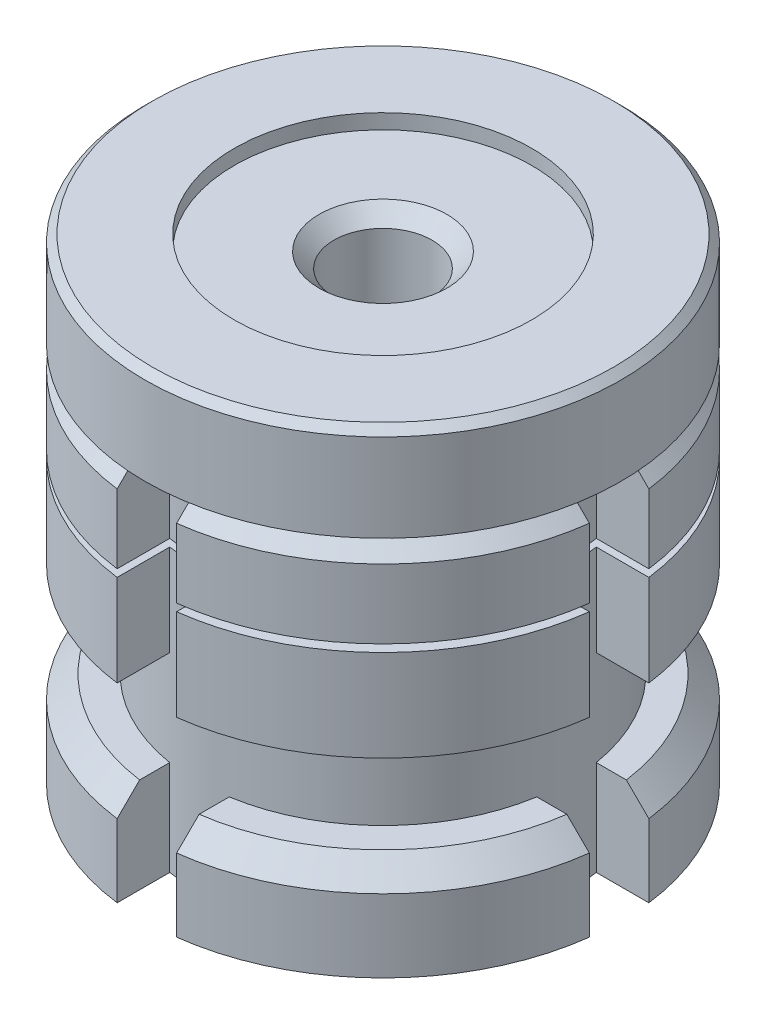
from build123d import *
from build123d.topology import SkipClean

# Parameters (mm, degrees)
SKETCH1_R           = 16
BOSS_EXTRUDE1_DEPTH = 12.8
SKETCH2_W           = 6
SKETCH2_H           = 0.5
SKETCH3_R           = 12.5
BOSS_EXTRUDE2_DEPTH = 12.8
SKETCH4_R           = 16
BOSS_EXTRUDE3_DEPTH = 6.4
CUT_EXTRUDE4_START  = -25.6
CUT_EXTRUDE4_DEPTH  = 25.6
CHAMFER1_SIZE       = 1.5
SKETCH6_R           = 16
BOSS_EXTRUDE4_DEPTH = 6.4
CHAMFER2_SIZE       = 0.5
CUT_EXTRUDE5_START  = -1
SKETCH7_R           = 10
CUT_EXTRUDE5_DEPTH  = 1
SKETCH8_R           = 3.3
CUT_EXTRUDE6_DEPTH  = 31
CHAMFER3_SIZE       = 1


with BuildPart() as part:
    # Sketch1 → Boss-Extrude1 (new body)
    with BuildSketch(Plane(origin=(0, 0, 0), x_dir=(1, 0, 0), z_dir=(0, 1, 0))):
        with Locations(Location((0, 0, 0), (0, 0, 270))):
            Circle(SKETCH1_R)
    extrude(amount=BOSS_EXTRUDE1_DEPTH)

    # Sketch2 → Cut-Revolve1 (revolve, cut)
    with BuildSketch(Plane(origin=(0, 0, 0), x_dir=(0, 0, -1), z_dir=(1, 0, 0))):
        with Locations((-13, 6.4)):
            Rectangle(SKETCH2_W, SKETCH2_H)
    revolve(axis=Axis((0, 13.26477, 0), (0, -1, 0)), mode=Mode.SUBTRACT)

    # Sketch3 → Boss-Extrude2 (add)
    with BuildSketch(Plane.XZ):
        with Locations(Location((0, 0, 0), (0, 0, 270))):
            Circle(SKETCH3_R)
    extrude(amount=BOSS_EXTRUDE2_DEPTH)

    # Sketch4 → Boss-Extrude3 (add)
    with BuildSketch(Plane.XZ.offset(12.8)):
        with Locations(Location((0, 0, 0), (0, 0, 90))):
            Circle(SKETCH4_R)
    extrude(amount=-BOSS_EXTRUDE3_DEPTH)

    # Sketch5 → Cut-Extrude4 (cut)
    with SkipClean():  # the faces are left unmerged after this step: merging them gives an invalid solid
        with BuildSketch(Plane(origin=(0, 12.8, 0), x_dir=(1, 0, 0), z_dir=(0, 1, 0)).offset(CUT_EXTRUDE4_START)):
            with BuildLine():
                Line((-15.874508, 2), (-12.338963, 2))
                ThreePointArc((-12.338963, 2), (-12.5, 0), (-12.338963, -2))
                Line((-12.338963, -2), (-15.874508, -2))
                ThreePointArc((-15.874508, -2), (-16, 0), (-15.874508, 2))
            make_face()
            with BuildLine():
                Line((-2, 15.874508), (-2, 12.338963))
                ThreePointArc((-2, 12.338963), (0, 12.5), (2, 12.338963))
                Line((2, 12.338963), (2, 15.874508))
                ThreePointArc((2, 15.874508), (0, 16), (-2, 15.874508))
            make_face()
            with BuildLine():
                Line((12.338963, 2), (15.874508, 2))
                ThreePointArc((15.874508, 2), (16, 0), (15.874508, -2))
                Line((15.874508, -2), (12.338963, -2))
                ThreePointArc((12.338963, -2), (12.5, 0), (12.338963, 2))
            make_face()
            with BuildLine():
                Line((-2, -12.338963), (-2, -15.874508))
                ThreePointArc((-2, -15.874508), (0, -16), (2, -15.874508))
                Line((2, -15.874508), (2, -12.338963))
                ThreePointArc((2, -12.338963), (0, -12.5), (-2, -12.338963))
            make_face()
        extrude(amount=CUT_EXTRUDE4_DEPTH, mode=Mode.SUBTRACT)

    # Chamfer1
    chamfer1_edges = [part.edges().sort_by_distance(p)[0] for p in [
        (11.313708, -6.4, -11.313708),
        (11.313708, -6.4, 11.313708),
        (-11.313708, -6.4, 11.313708),
        (-11.313708, -6.4, -11.313708),
        (11.313708, 12.8, 11.313708),
        (11.313708, 12.8, -11.313708),
        (-11.313708, 12.8, -11.313708),
        (-11.313708, 12.8, 11.313708),
    ]]
    chamfer(chamfer1_edges, length=CHAMFER1_SIZE)

    # Sketch6 → Boss-Extrude4 (add)
    with BuildSketch(Plane(origin=(0, 12.8, 0), x_dir=(1, 0, 0), z_dir=(0, 1, 0))):
        with Locations(Location((0, 0, 0), (0, 0, 270))):
            Circle(SKETCH6_R)
    extrude(amount=BOSS_EXTRUDE4_DEPTH)

    # Chamfer2
    chamfer2_edges = [part.edges().sort_by_distance(p)[0] for p in [
        (0, 19.2, -16),
    ]]
    chamfer(chamfer2_edges, length=CHAMFER2_SIZE)

    # Sketch7 → Cut-Extrude5 (cut)
    with BuildSketch(Plane(origin=(0, 19.2, 0), x_dir=(1, 0, 0), z_dir=(0, 1, 0)).offset(CUT_EXTRUDE5_START)):
        with Locations(Location((0, 0, 0), (0, 0, 270))):
            Circle(SKETCH7_R)
    extrude(amount=CUT_EXTRUDE5_DEPTH, mode=Mode.SUBTRACT)

    # Sketch8 → Cut-Extrude6 (cut)
    with BuildSketch(Plane(origin=(0, 18.2, 0), x_dir=(1, 0, 0), z_dir=(0, 1, 0))):
        with Locations(Location((0, 0, 0), (0, 0, 270))):
            Circle(SKETCH8_R)
    extrude(amount=-CUT_EXTRUDE6_DEPTH, mode=Mode.SUBTRACT)

    # Chamfer3
    chamfer3_edges = [part.edges().sort_by_distance(p)[0] for p in [
        (0, 18.2, -3.3),
        (0, -12.8, -3.3),
    ]]
    chamfer(chamfer3_edges, length=CHAMFER3_SIZE)


solid = part.part
